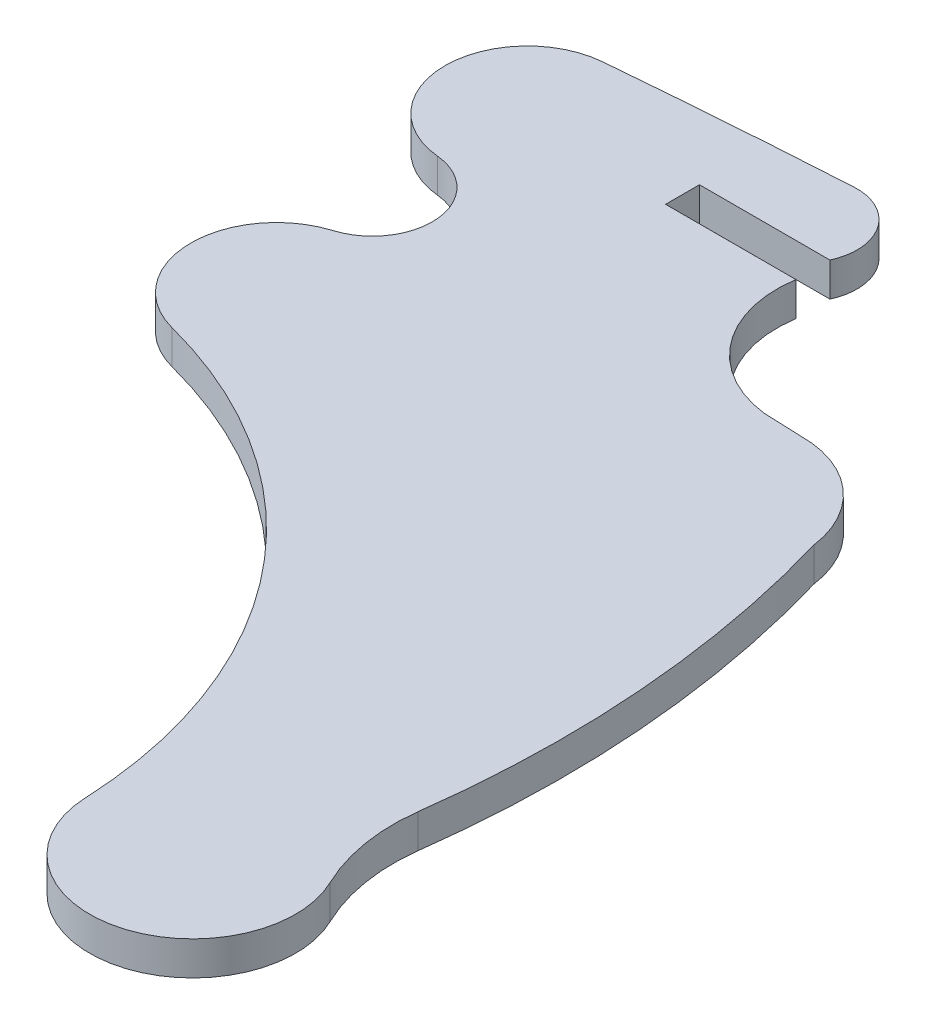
ISO-10303-21;
HEADER;
FILE_DESCRIPTION(('STEP AP214'),'2;1');
FILE_NAME('part.step','',(''),(''),'','','');
FILE_SCHEMA(('AUTOMOTIVE_DESIGN { 1 0 10303 214 1 1 1 1 }'));
ENDSEC;
DATA;
#1=APPLICATION_CONTEXT('core data for automotive mechanical design processes');
#2=APPLICATION_PROTOCOL_DEFINITION('international standard','automotive_design',2000,#1);
#3=PRODUCT_CONTEXT('',#1,'mechanical');
#4=PRODUCT('Part','Part','',(#3));
#5=PRODUCT_RELATED_PRODUCT_CATEGORY('part','',(#4));
#6=PRODUCT_DEFINITION_FORMATION('','',#4);
#7=PRODUCT_DEFINITION_CONTEXT('part definition',#1,'design');
#8=PRODUCT_DEFINITION('design','',#6,#7);
#9=PRODUCT_DEFINITION_SHAPE('','',#8);
#10=(LENGTH_UNIT() NAMED_UNIT(*) SI_UNIT(.MILLI.,.METRE.));
#11=(NAMED_UNIT(*) PLANE_ANGLE_UNIT() SI_UNIT($,.RADIAN.));
#12=(NAMED_UNIT(*) SI_UNIT($,.STERADIAN.) SOLID_ANGLE_UNIT());
#13=UNCERTAINTY_MEASURE_WITH_UNIT(LENGTH_MEASURE(1.E-05),#10,'distance_accuracy_value','');
#14=(GEOMETRIC_REPRESENTATION_CONTEXT(3) GLOBAL_UNCERTAINTY_ASSIGNED_CONTEXT((#13)) GLOBAL_UNIT_ASSIGNED_CONTEXT((#10,
#11,#12)) REPRESENTATION_CONTEXT('',''));
#15=CARTESIAN_POINT('',(0.,0.,0.));
#16=DIRECTION('',(0.,0.,1.));
#17=DIRECTION('',(1.,0.,0.));
#18=AXIS2_PLACEMENT_3D('',#15,#16,#17);
#19=CARTESIAN_POINT('',(-41930.5782253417,3.,-18255.2247567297));
#20=DIRECTION('',(0.,-1.,0.));
#21=DIRECTION('',(0.,0.,-1.));
#22=AXIS2_PLACEMENT_3D('',#19,#20,#21);
#23=CYLINDRICAL_SURFACE('',#22,4.69438040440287);
#24=CARTESIAN_POINT('',(-41930.5782253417,0.,-18255.2247567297));
#25=DIRECTION('',(0.,1.,0.));
#26=DIRECTION('',(0.,0.,1.));
#27=AXIS2_PLACEMENT_3D('',#24,#25,#26);
#28=CIRCLE('',#27,4.69438040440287);
#29=CARTESIAN_POINT('',(-41926.320312,0.,-18253.248047));
#30=VERTEX_POINT('',#29);
#31=CARTESIAN_POINT('',(-41930.847201,0.,-18259.9114250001));
#32=VERTEX_POINT('',#31);
#33=EDGE_CURVE('E174',#30,#32,#28,.T.);
#34=ORIENTED_EDGE('',*,*,#33,.T.);
#35=DIRECTION('',(0.,-1.,0.));
#36=VECTOR('',#35,1.);
#37=CARTESIAN_POINT('',(-41930.847201,3.,-18259.9114250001));
#38=LINE('',#37,#36);
#39=CARTESIAN_POINT('',(-41930.847201,3.,-18259.9114250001));
#40=VERTEX_POINT('',#39);
#41=EDGE_CURVE('E11',#40,#32,#38,.T.);
#42=ORIENTED_EDGE('',*,*,#41,.F.);
#43=CARTESIAN_POINT('',(-41930.5782253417,3.,-18255.2247567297));
#44=DIRECTION('',(0.,1.,0.));
#45=DIRECTION('',(0.,0.,1.));
#46=AXIS2_PLACEMENT_3D('',#43,#44,#45);
#47=CIRCLE('',#46,4.69438040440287);
#48=CARTESIAN_POINT('',(-41926.320312,3.,-18253.248047));
#49=VERTEX_POINT('',#48);
#50=EDGE_CURVE('E202',#49,#40,#47,.T.);
#51=ORIENTED_EDGE('',*,*,#50,.F.);
#52=DIRECTION('',(0.,-1.,0.));
#53=VECTOR('',#52,1.);
#54=CARTESIAN_POINT('',(-41926.320312,3.,-18253.248047));
#55=LINE('',#54,#53);
#56=EDGE_CURVE('E170',#49,#30,#55,.T.);
#57=ORIENTED_EDGE('',*,*,#56,.T.);
#58=EDGE_LOOP('',(#34,#42,#51,#57));
#59=FACE_BOUND('',#58,.T.);
#60=ADVANCED_FACE('F36',(#59),#23,.T.);
#61=CARTESIAN_POINT('',(-41892.5390600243,3.,-17595.9492191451));
#62=DIRECTION('',(0.,-1.,0.));
#63=DIRECTION('',(0.,0.,-1.));
#64=AXIS2_PLACEMENT_3D('',#61,#62,#63);
#65=CYLINDRICAL_SURFACE('',#64,665.066406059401);
#66=CARTESIAN_POINT('',(-41892.5390600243,0.,-17595.9492191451));
#67=DIRECTION('',(0.,1.,0.));
#68=DIRECTION('',(0.,0.,1.));
#69=AXIS2_PLACEMENT_3D('',#66,#67,#68);
#70=CIRCLE('',#69,665.066406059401);
#71=CARTESIAN_POINT('',(-41951.6236900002,0.,-18258.385881));
#72=VERTEX_POINT('',#71);
#73=EDGE_CURVE('E177',#32,#72,#70,.T.);
#74=ORIENTED_EDGE('',*,*,#73,.T.);
#75=DIRECTION('',(0.,-1.,0.));
#76=VECTOR('',#75,1.);
#77=CARTESIAN_POINT('',(-41951.6236900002,3.,-18258.385881));
#78=LINE('',#77,#76);
#79=CARTESIAN_POINT('',(-41951.6236900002,3.,-18258.385881));
#80=VERTEX_POINT('',#79);
#81=EDGE_CURVE('E44',#80,#72,#78,.T.);
#82=ORIENTED_EDGE('',*,*,#81,.F.);
#83=CARTESIAN_POINT('',(-41892.5390600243,3.,-17595.9492191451));
#84=DIRECTION('',(0.,1.,0.));
#85=DIRECTION('',(0.,0.,1.));
#86=AXIS2_PLACEMENT_3D('',#83,#84,#85);
#87=CIRCLE('',#86,665.066406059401);
#88=EDGE_CURVE('E116',#40,#80,#87,.T.);
#89=ORIENTED_EDGE('',*,*,#88,.F.);
#90=ORIENTED_EDGE('',*,*,#41,.T.);
#91=EDGE_LOOP('',(#74,#82,#89,#90));
#92=FACE_BOUND('',#91,.T.);
#93=ADVANCED_FACE('F295',(#92),#65,.T.);
#94=CARTESIAN_POINT('',(-41950.9765596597,3.,-18251.1102450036));
#95=DIRECTION('',(0.,-1.,0.));
#96=DIRECTION('',(0.,0.,-1.));
#97=AXIS2_PLACEMENT_3D('',#94,#95,#96);
#98=CYLINDRICAL_SURFACE('',#97,7.30435875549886);
#99=CARTESIAN_POINT('',(-41950.9765596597,0.,-18251.1102450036));
#100=DIRECTION('',(0.,1.,0.));
#101=DIRECTION('',(0.,0.,1.));
#102=AXIS2_PLACEMENT_3D('',#99,#100,#101);
#103=CIRCLE('',#102,7.30435875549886);
#104=CARTESIAN_POINT('',(-41951.662825,0.,-18243.8381959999));
#105=VERTEX_POINT('',#104);
#106=EDGE_CURVE('E179',#72,#105,#103,.T.);
#107=ORIENTED_EDGE('',*,*,#106,.T.);
#108=DIRECTION('',(0.,-1.,0.));
#109=VECTOR('',#108,1.);
#110=CARTESIAN_POINT('',(-41951.662825,3.,-18243.8381959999));
#111=LINE('',#110,#109);
#112=CARTESIAN_POINT('',(-41951.662825,3.,-18243.8381959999));
#113=VERTEX_POINT('',#112);
#114=EDGE_CURVE('E230',#113,#105,#111,.T.);
#115=ORIENTED_EDGE('',*,*,#114,.F.);
#116=CARTESIAN_POINT('',(-41950.9765596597,3.,-18251.1102450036));
#117=DIRECTION('',(0.,1.,0.));
#118=DIRECTION('',(0.,0.,1.));
#119=AXIS2_PLACEMENT_3D('',#116,#117,#118);
#120=CIRCLE('',#119,7.30435875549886);
#121=EDGE_CURVE('E238',#80,#113,#120,.T.);
#122=ORIENTED_EDGE('',*,*,#121,.F.);
#123=ORIENTED_EDGE('',*,*,#81,.T.);
#124=EDGE_LOOP('',(#107,#115,#122,#123));
#125=FACE_BOUND('',#124,.T.);
#126=ADVANCED_FACE('F236',(#125),#98,.T.);
#127=CARTESIAN_POINT('',(-41952.1601470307,3.,-18238.5604603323));
#128=DIRECTION('',(0.,-1.,0.));
#129=DIRECTION('',(0.,0.,-1.));
#130=AXIS2_PLACEMENT_3D('',#127,#128,#129);
#131=CYLINDRICAL_SURFACE('',#130,5.30111525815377);
#132=CARTESIAN_POINT('',(-41952.1601470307,0.,-18238.5604603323));
#133=DIRECTION('',(0.,-1.,0.));
#134=DIRECTION('',(0.,0.,1.));
#135=AXIS2_PLACEMENT_3D('',#132,#133,#134);
#136=CIRCLE('',#135,5.30111525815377);
#137=CARTESIAN_POINT('',(-41950.592544,0.,-18233.496426));
#138=VERTEX_POINT('',#137);
#139=EDGE_CURVE('E181',#105,#138,#136,.T.);
#140=ORIENTED_EDGE('',*,*,#139,.T.);
#141=DIRECTION('',(0.,-1.,0.));
#142=VECTOR('',#141,1.);
#143=CARTESIAN_POINT('',(-41950.592544,3.,-18233.496426));
#144=LINE('',#143,#142);
#145=CARTESIAN_POINT('',(-41950.592544,3.,-18233.496426));
#146=VERTEX_POINT('',#145);
#147=EDGE_CURVE('E227',#146,#138,#144,.T.);
#148=ORIENTED_EDGE('',*,*,#147,.F.);
#149=CARTESIAN_POINT('',(-41952.1601470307,3.,-18238.5604603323));
#150=DIRECTION('',(0.,-1.,0.));
#151=DIRECTION('',(0.,0.,1.));
#152=AXIS2_PLACEMENT_3D('',#149,#150,#151);
#153=CIRCLE('',#152,5.30111525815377);
#154=EDGE_CURVE('E256',#113,#146,#153,.T.);
#155=ORIENTED_EDGE('',*,*,#154,.F.);
#156=ORIENTED_EDGE('',*,*,#114,.T.);
#157=EDGE_LOOP('',(#140,#148,#155,#156));
#158=FACE_BOUND('',#157,.T.);
#159=ADVANCED_FACE('F247',(#158),#131,.F.);
#160=CARTESIAN_POINT('',(-41948.3554161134,3.,-18226.2534466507));
#161=DIRECTION('',(0.,-1.,0.));
#162=DIRECTION('',(0.,0.,-1.));
#163=AXIS2_PLACEMENT_3D('',#160,#161,#162);
#164=CYLINDRICAL_SURFACE('',#163,7.58059964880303);
#165=CARTESIAN_POINT('',(-41948.3554161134,0.,-18226.2534466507));
#166=DIRECTION('',(0.,1.,0.));
#167=DIRECTION('',(0.,0.,1.));
#168=AXIS2_PLACEMENT_3D('',#165,#166,#167);
#169=CIRCLE('',#168,7.58059964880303);
#170=CARTESIAN_POINT('',(-41950.272967,0.,-18218.919383));
#171=VERTEX_POINT('',#170);
#172=EDGE_CURVE('E183',#138,#171,#169,.T.);
#173=ORIENTED_EDGE('',*,*,#172,.T.);
#174=DIRECTION('',(0.,-1.,0.));
#175=VECTOR('',#174,1.);
#176=CARTESIAN_POINT('',(-41950.272967,3.,-18218.919383));
#177=LINE('',#176,#175);
#178=CARTESIAN_POINT('',(-41950.272967,3.,-18218.919383));
#179=VERTEX_POINT('',#178);
#180=EDGE_CURVE('E224',#179,#171,#177,.T.);
#181=ORIENTED_EDGE('',*,*,#180,.F.);
#182=CARTESIAN_POINT('',(-41948.3554161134,3.,-18226.2534466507));
#183=DIRECTION('',(0.,1.,0.));
#184=DIRECTION('',(0.,0.,1.));
#185=AXIS2_PLACEMENT_3D('',#182,#183,#184);
#186=CIRCLE('',#185,7.58059964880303);
#187=EDGE_CURVE('E253',#146,#179,#186,.T.);
#188=ORIENTED_EDGE('',*,*,#187,.F.);
#189=ORIENTED_EDGE('',*,*,#147,.T.);
#190=EDGE_LOOP('',(#173,#181,#188,#189));
#191=FACE_BOUND('',#190,.T.);
#192=ADVANCED_FACE('F251',(#191),#164,.T.);
#193=CARTESIAN_POINT('',(-41961.1957392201,3.,-18177.117716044));
#194=DIRECTION('',(0.,-1.,0.));
#195=DIRECTION('',(0.,0.,-1.));
#196=AXIS2_PLACEMENT_3D('',#193,#194,#195);
#197=CYLINDRICAL_SURFACE('',#196,43.205165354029);
#198=CARTESIAN_POINT('',(-41961.1957392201,0.,-18177.117716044));
#199=DIRECTION('',(0.,-1.,0.));
#200=DIRECTION('',(0.,0.,1.));
#201=AXIS2_PLACEMENT_3D('',#198,#199,#200);
#202=CIRCLE('',#201,43.205165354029);
#203=CARTESIAN_POINT('',(-41918.0313,0.,-18178.9932159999));
#204=VERTEX_POINT('',#203);
#205=EDGE_CURVE('E185',#171,#204,#202,.T.);
#206=ORIENTED_EDGE('',*,*,#205,.T.);
#207=DIRECTION('',(0.,-1.,0.));
#208=VECTOR('',#207,1.);
#209=CARTESIAN_POINT('',(-41918.0313,3.,-18178.9932159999));
#210=LINE('',#209,#208);
#211=CARTESIAN_POINT('',(-41918.0313,3.,-18178.9932159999));
#212=VERTEX_POINT('',#211);
#213=EDGE_CURVE('E221',#212,#204,#210,.T.);
#214=ORIENTED_EDGE('',*,*,#213,.F.);
#215=CARTESIAN_POINT('',(-41961.1957392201,3.,-18177.117716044));
#216=DIRECTION('',(0.,-1.,0.));
#217=DIRECTION('',(0.,0.,1.));
#218=AXIS2_PLACEMENT_3D('',#215,#216,#217);
#219=CIRCLE('',#218,43.205165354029);
#220=EDGE_CURVE('E255',#179,#212,#219,.T.);
#221=ORIENTED_EDGE('',*,*,#220,.F.);
#222=ORIENTED_EDGE('',*,*,#180,.T.);
#223=EDGE_LOOP('',(#206,#214,#221,#222));
#224=FACE_BOUND('',#223,.T.);
#225=ADVANCED_FACE('F308',(#224),#197,.F.);
#226=CARTESIAN_POINT('',(-41908.9145440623,3.,-18179.388550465));
#227=DIRECTION('',(0.,-1.,0.));
#228=DIRECTION('',(0.,0.,-1.));
#229=AXIS2_PLACEMENT_3D('',#226,#227,#228);
#230=CYLINDRICAL_SURFACE('',#229,9.12532345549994);
#231=CARTESIAN_POINT('',(-41908.9145440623,0.,-18179.388550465));
#232=DIRECTION('',(0.,1.,0.));
#233=DIRECTION('',(0.,0.,1.));
#234=AXIS2_PLACEMENT_3D('',#231,#232,#233);
#235=CIRCLE('',#234,9.12532345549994);
#236=CARTESIAN_POINT('',(-41900.700055,0.,-18183.362679));
#237=VERTEX_POINT('',#236);
#238=EDGE_CURVE('E187',#204,#237,#235,.T.);
#239=ORIENTED_EDGE('',*,*,#238,.T.);
#240=DIRECTION('',(0.,-1.,0.));
#241=VECTOR('',#240,1.);
#242=CARTESIAN_POINT('',(-41900.700055,3.,-18183.362679));
#243=LINE('',#242,#241);
#244=CARTESIAN_POINT('',(-41900.700055,3.,-18183.362679));
#245=VERTEX_POINT('',#244);
#246=EDGE_CURVE('E218',#245,#237,#243,.T.);
#247=ORIENTED_EDGE('',*,*,#246,.F.);
#248=CARTESIAN_POINT('',(-41908.9145440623,3.,-18179.388550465));
#249=DIRECTION('',(0.,1.,0.));
#250=DIRECTION('',(0.,0.,1.));
#251=AXIS2_PLACEMENT_3D('',#248,#249,#250);
#252=CIRCLE('',#251,9.12532345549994);
#253=EDGE_CURVE('E258',#212,#245,#252,.T.);
#254=ORIENTED_EDGE('',*,*,#253,.F.);
#255=ORIENTED_EDGE('',*,*,#213,.T.);
#256=EDGE_LOOP('',(#239,#247,#254,#255));
#257=FACE_BOUND('',#256,.T.);
#258=ADVANCED_FACE('F311',(#257),#230,.T.);
#259=CARTESIAN_POINT('',(-41885.6841749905,3.,-18190.6304671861));
#260=DIRECTION('',(0.,-1.,0.));
#261=DIRECTION('',(0.,0.,-1.));
#262=AXIS2_PLACEMENT_3D('',#259,#260,#261);
#263=CYLINDRICAL_SURFACE('',#262,16.6822479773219);
#264=CARTESIAN_POINT('',(-41885.6841749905,0.,-18190.6304671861));
#265=DIRECTION('',(0.,-1.,0.));
#266=DIRECTION('',(0.,0.,1.));
#267=AXIS2_PLACEMENT_3D('',#264,#265,#266);
#268=CIRCLE('',#267,16.6822479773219);
#269=CARTESIAN_POINT('',(-41902.2402229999,0.,-18192.678557));
#270=VERTEX_POINT('',#269);
#271=EDGE_CURVE('E189',#237,#270,#268,.T.);
#272=ORIENTED_EDGE('',*,*,#271,.T.);
#273=DIRECTION('',(0.,-1.,0.));
#274=VECTOR('',#273,1.);
#275=CARTESIAN_POINT('',(-41902.2402229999,3.,-18192.678557));
#276=LINE('',#275,#274);
#277=CARTESIAN_POINT('',(-41902.2402229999,3.,-18192.678557));
#278=VERTEX_POINT('',#277);
#279=EDGE_CURVE('E215',#278,#270,#276,.T.);
#280=ORIENTED_EDGE('',*,*,#279,.F.);
#281=CARTESIAN_POINT('',(-41885.6841749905,3.,-18190.6304671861));
#282=DIRECTION('',(0.,-1.,0.));
#283=DIRECTION('',(0.,0.,1.));
#284=AXIS2_PLACEMENT_3D('',#281,#282,#283);
#285=CIRCLE('',#284,16.6822479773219);
#286=EDGE_CURVE('E264',#245,#278,#285,.T.);
#287=ORIENTED_EDGE('',*,*,#286,.F.);
#288=ORIENTED_EDGE('',*,*,#246,.T.);
#289=EDGE_LOOP('',(#272,#280,#287,#288));
#290=FACE_BOUND('',#289,.T.);
#291=ADVANCED_FACE('F315',(#290),#263,.F.);
#292=CARTESIAN_POINT('',(-41993.7932295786,3.,-18204.7455682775));
#293=DIRECTION('',(0.,-1.,0.));
#294=DIRECTION('',(0.,0.,-1.));
#295=AXIS2_PLACEMENT_3D('',#292,#293,#294);
#296=CYLINDRICAL_SURFACE('',#295,92.3448199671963);
#297=CARTESIAN_POINT('',(-41993.7932295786,0.,-18204.7455682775));
#298=DIRECTION('',(0.,1.,0.));
#299=DIRECTION('',(0.,0.,1.));
#300=AXIS2_PLACEMENT_3D('',#297,#298,#299);
#301=CIRCLE('',#300,92.3448199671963);
#302=CARTESIAN_POINT('',(-41905.170188,0.,-18230.697876));
#303=VERTEX_POINT('',#302);
#304=EDGE_CURVE('E191',#270,#303,#301,.T.);
#305=ORIENTED_EDGE('',*,*,#304,.T.);
#306=DIRECTION('',(0.,-1.,0.));
#307=VECTOR('',#306,1.);
#308=CARTESIAN_POINT('',(-41905.170188,3.,-18230.697876));
#309=LINE('',#308,#307);
#310=CARTESIAN_POINT('',(-41905.170188,3.,-18230.697876));
#311=VERTEX_POINT('',#310);
#312=EDGE_CURVE('E212',#311,#303,#309,.T.);
#313=ORIENTED_EDGE('',*,*,#312,.F.);
#314=CARTESIAN_POINT('',(-41993.7932295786,3.,-18204.7455682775));
#315=DIRECTION('',(0.,1.,0.));
#316=DIRECTION('',(0.,0.,1.));
#317=AXIS2_PLACEMENT_3D('',#314,#315,#316);
#318=CIRCLE('',#317,92.3448199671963);
#319=EDGE_CURVE('E266',#278,#311,#318,.T.);
#320=ORIENTED_EDGE('',*,*,#319,.F.);
#321=ORIENTED_EDGE('',*,*,#279,.T.);
#322=EDGE_LOOP('',(#305,#313,#320,#321));
#323=FACE_BOUND('',#322,.T.);
#324=ADVANCED_FACE('F319',(#323),#296,.T.);
#325=CARTESIAN_POINT('',(-41914.0199248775,3.,-18229.5258886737));
#326=DIRECTION('',(0.,-1.,0.));
#327=DIRECTION('',(0.,0.,-1.));
#328=AXIS2_PLACEMENT_3D('',#325,#326,#327);
#329=CYLINDRICAL_SURFACE('',#328,8.92700381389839);
#330=CARTESIAN_POINT('',(-41914.0199248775,0.,-18229.5258886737));
#331=DIRECTION('',(0.,1.,0.));
#332=DIRECTION('',(0.,0.,1.));
#333=AXIS2_PLACEMENT_3D('',#330,#331,#332);
#334=CIRCLE('',#333,8.92700381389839);
#335=CARTESIAN_POINT('',(-41913.11387,0.,-18238.406793));
#336=VERTEX_POINT('',#335);
#337=EDGE_CURVE('E193',#303,#336,#334,.T.);
#338=ORIENTED_EDGE('',*,*,#337,.T.);
#339=DIRECTION('',(0.,-1.,0.));
#340=VECTOR('',#339,1.);
#341=CARTESIAN_POINT('',(-41913.11387,3.,-18238.406793));
#342=LINE('',#341,#340);
#343=CARTESIAN_POINT('',(-41913.11387,3.,-18238.406793));
#344=VERTEX_POINT('',#343);
#345=EDGE_CURVE('E209',#344,#336,#342,.T.);
#346=ORIENTED_EDGE('',*,*,#345,.F.);
#347=CARTESIAN_POINT('',(-41914.0199248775,3.,-18229.5258886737));
#348=DIRECTION('',(0.,1.,0.));
#349=DIRECTION('',(0.,0.,1.));
#350=AXIS2_PLACEMENT_3D('',#347,#348,#349);
#351=CIRCLE('',#350,8.92700381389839);
#352=EDGE_CURVE('E268',#311,#344,#351,.T.);
#353=ORIENTED_EDGE('',*,*,#352,.F.);
#354=ORIENTED_EDGE('',*,*,#312,.T.);
#355=EDGE_LOOP('',(#338,#346,#353,#354));
#356=FACE_BOUND('',#355,.T.);
#357=ADVANCED_FACE('F323',(#356),#329,.T.);
#358=CARTESIAN_POINT('',(-41913.11387,3.,-18238.406793));
#359=DIRECTION('',(-0.0405453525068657,0.,0.999177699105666));
#360=DIRECTION('',(0.999177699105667,0.,0.0405453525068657));
#361=AXIS2_PLACEMENT_3D('',#358,#359,#360);
#362=PLANE('',#361);
#363=DIRECTION('',(-0.999177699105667,0.,-0.0405453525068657));
#364=VECTOR('',#363,1.);
#365=CARTESIAN_POINT('',(-41913.11387,0.,-18238.406793));
#366=LINE('',#365,#364);
#367=CARTESIAN_POINT('',(-41917.480469,0.,-18238.583984));
#368=VERTEX_POINT('',#367);
#369=EDGE_CURVE('E195',#336,#368,#366,.T.);
#370=ORIENTED_EDGE('',*,*,#369,.T.);
#371=DIRECTION('',(0.,-1.,0.));
#372=VECTOR('',#371,1.);
#373=CARTESIAN_POINT('',(-41917.480469,3.,-18238.583984));
#374=LINE('',#373,#372);
#375=CARTESIAN_POINT('',(-41917.480469,3.,-18238.583984));
#376=VERTEX_POINT('',#375);
#377=EDGE_CURVE('E206',#376,#368,#374,.T.);
#378=ORIENTED_EDGE('',*,*,#377,.F.);
#379=DIRECTION('',(-0.999177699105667,0.,-0.0405453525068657));
#380=VECTOR('',#379,1.);
#381=CARTESIAN_POINT('',(-41913.11387,3.,-18238.406793));
#382=LINE('',#381,#380);
#383=EDGE_CURVE('E270',#344,#376,#382,.T.);
#384=ORIENTED_EDGE('',*,*,#383,.F.);
#385=ORIENTED_EDGE('',*,*,#345,.T.);
#386=EDGE_LOOP('',(#370,#378,#384,#385));
#387=FACE_BOUND('',#386,.T.);
#388=ADVANCED_FACE('F276',(#387),#362,.F.);
#389=CARTESIAN_POINT('',(-41916.2614631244,3.,-18248.693021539));
#390=DIRECTION('',(0.,-1.,0.));
#391=DIRECTION('',(0.,0.,-1.));
#392=AXIS2_PLACEMENT_3D('',#389,#390,#391);
#393=CYLINDRICAL_SURFACE('',#392,10.1822696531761);
#394=CARTESIAN_POINT('',(-41916.2614631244,0.,-18248.693021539));
#395=DIRECTION('',(0.,-1.,0.));
#396=DIRECTION('',(0.,0.,1.));
#397=AXIS2_PLACEMENT_3D('',#394,#395,#396);
#398=CIRCLE('',#397,10.1822696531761);
#399=CARTESIAN_POINT('',(-41926.324344,0.,-18250.247706));
#400=VERTEX_POINT('',#399);
#401=EDGE_CURVE('E197',#368,#400,#398,.T.);
#402=ORIENTED_EDGE('',*,*,#401,.T.);
#403=DIRECTION('',(0.,-1.,0.));
#404=VECTOR('',#403,1.);
#405=CARTESIAN_POINT('',(-41926.324344,3.,-18250.247706));
#406=LINE('',#405,#404);
#407=CARTESIAN_POINT('',(-41926.324344,3.,-18250.247706));
#408=VERTEX_POINT('',#407);
#409=EDGE_CURVE('E165',#408,#400,#406,.T.);
#410=ORIENTED_EDGE('',*,*,#409,.F.);
#411=CARTESIAN_POINT('',(-41916.2614631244,3.,-18248.693021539));
#412=DIRECTION('',(0.,-1.,0.));
#413=DIRECTION('',(0.,0.,1.));
#414=AXIS2_PLACEMENT_3D('',#411,#412,#413);
#415=CIRCLE('',#414,10.1822696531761);
#416=EDGE_CURVE('E156',#376,#408,#415,.T.);
#417=ORIENTED_EDGE('',*,*,#416,.F.);
#418=ORIENTED_EDGE('',*,*,#377,.T.);
#419=EDGE_LOOP('',(#402,#410,#417,#418));
#420=FACE_BOUND('',#419,.T.);
#421=ADVANCED_FACE('F280',(#420),#393,.F.);
#422=CARTESIAN_POINT('',(-41926.324344,3.,-18250.247706));
#423=DIRECTION('',(0.000139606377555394,0.,0.99999999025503));
#424=DIRECTION('',(0.99999999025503,0.,-0.000139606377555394));
#425=AXIS2_PLACEMENT_3D('',#422,#423,#424);
#426=PLANE('',#425);
#427=DIRECTION('',(-0.99999999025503,0.,0.000139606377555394));
#428=VECTOR('',#427,1.);
#429=CARTESIAN_POINT('',(-41926.324344,0.,-18250.247706));
#430=LINE('',#429,#428);
#431=CARTESIAN_POINT('',(-41937.871094,0.,-18250.246094));
#432=VERTEX_POINT('',#431);
#433=EDGE_CURVE('E164',#400,#432,#430,.T.);
#434=ORIENTED_EDGE('',*,*,#433,.T.);
#435=DIRECTION('',(0.,-1.,0.));
#436=VECTOR('',#435,1.);
#437=CARTESIAN_POINT('',(-41937.871094,3.,-18250.246094));
#438=LINE('',#437,#436);
#439=CARTESIAN_POINT('',(-41937.871094,3.,-18250.246094));
#440=VERTEX_POINT('',#439);
#441=EDGE_CURVE('E161',#440,#432,#438,.T.);
#442=ORIENTED_EDGE('',*,*,#441,.F.);
#443=DIRECTION('',(-0.99999999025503,0.,0.000139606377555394));
#444=VECTOR('',#443,1.);
#445=CARTESIAN_POINT('',(-41926.324344,3.,-18250.247706));
#446=LINE('',#445,#444);
#447=EDGE_CURVE('E150',#408,#440,#446,.T.);
#448=ORIENTED_EDGE('',*,*,#447,.F.);
#449=ORIENTED_EDGE('',*,*,#409,.T.);
#450=EDGE_LOOP('',(#434,#442,#448,#449));
#451=FACE_BOUND('',#450,.T.);
#452=ADVANCED_FACE('F162',(#451),#426,.F.);
#453=CARTESIAN_POINT('',(-41937.871094,3.,-18250.246094));
#454=DIRECTION('',(-1.,0.,0.));
#455=DIRECTION('',(0.,0.,1.));
#456=AXIS2_PLACEMENT_3D('',#453,#454,#455);
#457=PLANE('',#456);
#458=DIRECTION('',(0.,0.,-1.));
#459=VECTOR('',#458,1.);
#460=CARTESIAN_POINT('',(-41937.871094,0.,-18250.246094));
#461=LINE('',#460,#459);
#462=CARTESIAN_POINT('',(-41937.871094,0.,-18253.248047));
#463=VERTEX_POINT('',#462);
#464=EDGE_CURVE('E102',#432,#463,#461,.T.);
#465=ORIENTED_EDGE('',*,*,#464,.T.);
#466=DIRECTION('',(0.,-1.,0.));
#467=VECTOR('',#466,1.);
#468=CARTESIAN_POINT('',(-41937.871094,3.,-18253.248047));
#469=LINE('',#468,#467);
#470=CARTESIAN_POINT('',(-41937.871094,3.,-18253.248047));
#471=VERTEX_POINT('',#470);
#472=EDGE_CURVE('E166',#471,#463,#469,.T.);
#473=ORIENTED_EDGE('',*,*,#472,.F.);
#474=DIRECTION('',(0.,0.,-1.));
#475=VECTOR('',#474,1.);
#476=CARTESIAN_POINT('',(-41937.871094,3.,-18250.246094));
#477=LINE('',#476,#475);
#478=EDGE_CURVE('E154',#440,#471,#477,.T.);
#479=ORIENTED_EDGE('',*,*,#478,.F.);
#480=ORIENTED_EDGE('',*,*,#441,.T.);
#481=EDGE_LOOP('',(#465,#473,#479,#480));
#482=FACE_BOUND('',#481,.T.);
#483=ADVANCED_FACE('F168',(#482),#457,.F.);
#484=CARTESIAN_POINT('',(-41937.871094,3.,-18253.248047));
#485=DIRECTION('',(0.,0.,-1.));
#486=DIRECTION('',(-1.,0.,0.));
#487=AXIS2_PLACEMENT_3D('',#484,#485,#486);
#488=PLANE('',#487);
#489=DIRECTION('',(1.,0.,0.));
#490=VECTOR('',#489,1.);
#491=CARTESIAN_POINT('',(-41937.871094,0.,-18253.248047));
#492=LINE('',#491,#490);
#493=EDGE_CURVE('E108',#463,#30,#492,.T.);
#494=ORIENTED_EDGE('',*,*,#493,.T.);
#495=ORIENTED_EDGE('',*,*,#56,.F.);
#496=DIRECTION('',(1.,0.,0.));
#497=VECTOR('',#496,1.);
#498=CARTESIAN_POINT('',(-41937.871094,3.,-18253.248047));
#499=LINE('',#498,#497);
#500=EDGE_CURVE('E52',#471,#49,#499,.T.);
#501=ORIENTED_EDGE('',*,*,#500,.F.);
#502=ORIENTED_EDGE('',*,*,#472,.T.);
#503=EDGE_LOOP('',(#494,#495,#501,#502));
#504=FACE_BOUND('',#503,.T.);
#505=ADVANCED_FACE('F284',(#504),#488,.F.);
#506=CARTESIAN_POINT('',(-41930.5782253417,3.,-18255.2247567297));
#507=DIRECTION('',(0.,1.,0.));
#508=DIRECTION('',(0.,0.,1.));
#509=AXIS2_PLACEMENT_3D('',#506,#507,#508);
#510=PLANE('',#509);
#511=ORIENTED_EDGE('',*,*,#50,.T.);
#512=ORIENTED_EDGE('',*,*,#88,.T.);
#513=ORIENTED_EDGE('',*,*,#121,.T.);
#514=ORIENTED_EDGE('',*,*,#154,.T.);
#515=ORIENTED_EDGE('',*,*,#187,.T.);
#516=ORIENTED_EDGE('',*,*,#220,.T.);
#517=ORIENTED_EDGE('',*,*,#253,.T.);
#518=ORIENTED_EDGE('',*,*,#286,.T.);
#519=ORIENTED_EDGE('',*,*,#319,.T.);
#520=ORIENTED_EDGE('',*,*,#352,.T.);
#521=ORIENTED_EDGE('',*,*,#383,.T.);
#522=ORIENTED_EDGE('',*,*,#416,.T.);
#523=ORIENTED_EDGE('',*,*,#447,.T.);
#524=ORIENTED_EDGE('',*,*,#478,.T.);
#525=ORIENTED_EDGE('',*,*,#500,.T.);
#526=EDGE_LOOP('',(#511,#512,#513,#514,#515,#516,#517,#518,#519,#520,#521,#522,#523,#524,#525));
#527=FACE_BOUND('',#526,.T.);
#528=ADVANCED_FACE('F152',(#527),#510,.T.);
#529=CARTESIAN_POINT('',(-41930.5782253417,0.,-18255.2247567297));
#530=DIRECTION('',(0.,1.,0.));
#531=DIRECTION('',(0.,0.,1.));
#532=AXIS2_PLACEMENT_3D('',#529,#530,#531);
#533=PLANE('',#532);
#534=ORIENTED_EDGE('',*,*,#33,.F.);
#535=ORIENTED_EDGE('',*,*,#493,.F.);
#536=ORIENTED_EDGE('',*,*,#464,.F.);
#537=ORIENTED_EDGE('',*,*,#433,.F.);
#538=ORIENTED_EDGE('',*,*,#401,.F.);
#539=ORIENTED_EDGE('',*,*,#369,.F.);
#540=ORIENTED_EDGE('',*,*,#337,.F.);
#541=ORIENTED_EDGE('',*,*,#304,.F.);
#542=ORIENTED_EDGE('',*,*,#271,.F.);
#543=ORIENTED_EDGE('',*,*,#238,.F.);
#544=ORIENTED_EDGE('',*,*,#205,.F.);
#545=ORIENTED_EDGE('',*,*,#172,.F.);
#546=ORIENTED_EDGE('',*,*,#139,.F.);
#547=ORIENTED_EDGE('',*,*,#106,.F.);
#548=ORIENTED_EDGE('',*,*,#73,.F.);
#549=EDGE_LOOP('',(#534,#535,#536,#537,#538,#539,#540,#541,#542,#543,#544,#545,#546,#547,#548));
#550=FACE_BOUND('',#549,.T.);
#551=ADVANCED_FACE('F242',(#550),#533,.F.);
#552=CLOSED_SHELL('',(#60,#93,#126,#159,#192,#225,#258,#291,#324,#357,#388,#421,#452,#483,#505,
#528,#551));
#553=MANIFOLD_SOLID_BREP('B2',#552);
#554=ADVANCED_BREP_SHAPE_REPRESENTATION('',(#18,#553),#14);
#555=SHAPE_DEFINITION_REPRESENTATION(#9,#554);
ENDSEC;
END-ISO-10303-21;
